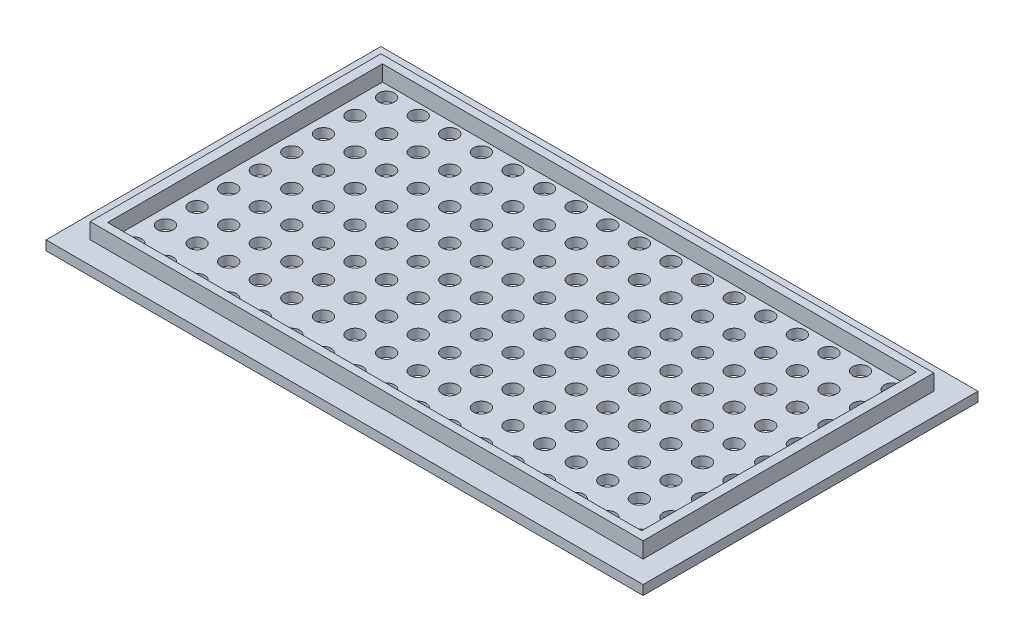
from build123d import *

# Parameters (mm, degrees)
SCHIZZO1_W                   = 189
SCHIZZO1_H                   = 106
SCHIZZO1_R                   = 2.5
ESTRUSIONE_ESTRUSIONE1_DEPTH = 3
SCHIZZO2_W                   = 175
SCHIZZO2_H                   = 92
SCHIZZO2_W_2                 = 169
SCHIZZO2_H_2                 = 87
ESTRUSIONE_ESTRUSIONE2_DEPTH = 5


with BuildPart() as part:
    # Schizzo1 → Estrusione-Estrusione1 (new body)
    with BuildSketch(Plane(origin=(0, 0, 0), x_dir=(1, 0, 0), z_dir=(0, 1, 0))):
        with Locations((-119.436215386, 8.367406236)):
            Rectangle(SCHIZZO1_W, SCHIZZO1_H)
        with Locations(Location((-199.037422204, 48.281681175, 0), (0, 0, 270))):
            Circle(SCHIZZO1_R, mode=Mode.SUBTRACT)
        with Locations(Location((-189.037422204, 48.281681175, 0), (0, 0, 270))):
            Circle(SCHIZZO1_R, mode=Mode.SUBTRACT)
        with Locations(Location((-179.037422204, 48.281681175, 0), (0, 0, 270))):
            Circle(SCHIZZO1_R, mode=Mode.SUBTRACT)
        with Locations(Location((-169.037422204, 48.281681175, 0), (0, 0, 270))):
            Circle(SCHIZZO1_R, mode=Mode.SUBTRACT)
        with Locations(Location((-159.037422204, 48.281681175, 0), (0, 0, 270))):
            Circle(SCHIZZO1_R, mode=Mode.SUBTRACT)
        with Locations(Location((-149.037422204, 48.281681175, 0), (0, 0, 270))):
            Circle(SCHIZZO1_R, mode=Mode.SUBTRACT)
        with Locations(Location((-139.037422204, 48.281681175, 0), (0, 0, 270))):
            Circle(SCHIZZO1_R, mode=Mode.SUBTRACT)
        with Locations(Location((-129.037422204, 48.281681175, 0), (0, 0, 270))):
            Circle(SCHIZZO1_R, mode=Mode.SUBTRACT)
        with Locations(Location((-119.037422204, 48.281681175, 0), (0, 0, 270))):
            Circle(SCHIZZO1_R, mode=Mode.SUBTRACT)
        with Locations(Location((-109.037422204, 48.281681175, 0), (0, 0, 270))):
            Circle(SCHIZZO1_R, mode=Mode.SUBTRACT)
        with Locations(Location((-99.037422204, 48.281681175, 0), (0, 0, 270))):
            Circle(SCHIZZO1_R, mode=Mode.SUBTRACT)
        with Locations(Location((-89.037422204, 48.281681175, 0), (0, 0, 270))):
            Circle(SCHIZZO1_R, mode=Mode.SUBTRACT)
        with Locations(Location((-79.037422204, 48.281681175, 0), (0, 0, 270))):
            Circle(SCHIZZO1_R, mode=Mode.SUBTRACT)
        with Locations(Location((-69.037422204, 48.281681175, 0), (0, 0, 270))):
            Circle(SCHIZZO1_R, mode=Mode.SUBTRACT)
        with Locations(Location((-59.037422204, 48.281681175, 0), (0, 0, 270))):
            Circle(SCHIZZO1_R, mode=Mode.SUBTRACT)
        with Locations(Location((-49.037422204, 48.281681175, 0), (0, 0, 270))):
            Circle(SCHIZZO1_R, mode=Mode.SUBTRACT)
        with Locations(Location((-39.037422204, 48.281681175, 0), (0, 0, 270))):
            Circle(SCHIZZO1_R, mode=Mode.SUBTRACT)
        with Locations(Location((-189.037422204, 38.281681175, 0), (0, 0, 270))):
            Circle(SCHIZZO1_R, mode=Mode.SUBTRACT)
        with Locations(Location((-179.037422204, 38.281681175, 0), (0, 0, 270))):
            Circle(SCHIZZO1_R, mode=Mode.SUBTRACT)
        with Locations(Location((-169.037422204, 38.281681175, 0), (0, 0, 270))):
            Circle(SCHIZZO1_R, mode=Mode.SUBTRACT)
        with Locations(Location((-159.037422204, 38.281681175, 0), (0, 0, 270))):
            Circle(SCHIZZO1_R, mode=Mode.SUBTRACT)
        with Locations(Location((-149.037422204, 38.281681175, 0), (0, 0, 270))):
            Circle(SCHIZZO1_R, mode=Mode.SUBTRACT)
        with Locations(Location((-139.037422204, 38.281681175, 0), (0, 0, 270))):
            Circle(SCHIZZO1_R, mode=Mode.SUBTRACT)
        with Locations(Location((-129.037422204, 38.281681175, 0), (0, 0, 270))):
            Circle(SCHIZZO1_R, mode=Mode.SUBTRACT)
        with Locations(Location((-119.037422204, 38.281681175, 0), (0, 0, 270))):
            Circle(SCHIZZO1_R, mode=Mode.SUBTRACT)
        with Locations(Location((-109.037422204, 38.281681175, 0), (0, 0, 270))):
            Circle(SCHIZZO1_R, mode=Mode.SUBTRACT)
        with Locations(Location((-99.037422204, 38.281681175, 0), (0, 0, 270))):
            Circle(SCHIZZO1_R, mode=Mode.SUBTRACT)
        with Locations(Location((-89.037422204, 38.281681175, 0), (0, 0, 270))):
            Circle(SCHIZZO1_R, mode=Mode.SUBTRACT)
        with Locations(Location((-79.037422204, 38.281681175, 0), (0, 0, 270))):
            Circle(SCHIZZO1_R, mode=Mode.SUBTRACT)
        with Locations(Location((-69.037422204, 38.281681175, 0), (0, 0, 270))):
            Circle(SCHIZZO1_R, mode=Mode.SUBTRACT)
        with Locations(Location((-59.037422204, 38.281681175, 0), (0, 0, 270))):
            Circle(SCHIZZO1_R, mode=Mode.SUBTRACT)
        with Locations(Location((-49.037422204, 38.281681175, 0), (0, 0, 270))):
            Circle(SCHIZZO1_R, mode=Mode.SUBTRACT)
        with Locations(Location((-39.037422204, 38.281681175, 0), (0, 0, 270))):
            Circle(SCHIZZO1_R, mode=Mode.SUBTRACT)
        with Locations(Location((-189.037422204, 28.281681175, 0), (0, 0, 270))):
            Circle(SCHIZZO1_R, mode=Mode.SUBTRACT)
        with Locations(Location((-179.037422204, 28.281681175, 0), (0, 0, 270))):
            Circle(SCHIZZO1_R, mode=Mode.SUBTRACT)
        with Locations(Location((-169.037422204, 28.281681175, 0), (0, 0, 270))):
            Circle(SCHIZZO1_R, mode=Mode.SUBTRACT)
        with Locations(Location((-159.037422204, 28.281681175, 0), (0, 0, 270))):
            Circle(SCHIZZO1_R, mode=Mode.SUBTRACT)
        with Locations(Location((-149.037422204, 28.281681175, 0), (0, 0, 270))):
            Circle(SCHIZZO1_R, mode=Mode.SUBTRACT)
        with Locations(Location((-139.037422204, 28.281681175, 0), (0, 0, 270))):
            Circle(SCHIZZO1_R, mode=Mode.SUBTRACT)
        with Locations(Location((-129.037422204, 28.281681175, 0), (0, 0, 270))):
            Circle(SCHIZZO1_R, mode=Mode.SUBTRACT)
        with Locations(Location((-119.037422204, 28.281681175, 0), (0, 0, 270))):
            Circle(SCHIZZO1_R, mode=Mode.SUBTRACT)
        with Locations(Location((-109.037422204, 28.281681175, 0), (0, 0, 270))):
            Circle(SCHIZZO1_R, mode=Mode.SUBTRACT)
        with Locations(Location((-99.037422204, 28.281681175, 0), (0, 0, 270))):
            Circle(SCHIZZO1_R, mode=Mode.SUBTRACT)
        with Locations(Location((-89.037422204, 28.281681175, 0), (0, 0, 270))):
            Circle(SCHIZZO1_R, mode=Mode.SUBTRACT)
        with Locations(Location((-79.037422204, 28.281681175, 0), (0, 0, 270))):
            Circle(SCHIZZO1_R, mode=Mode.SUBTRACT)
        with Locations(Location((-69.037422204, 28.281681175, 0), (0, 0, 270))):
            Circle(SCHIZZO1_R, mode=Mode.SUBTRACT)
        with Locations(Location((-59.037422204, 28.281681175, 0), (0, 0, 270))):
            Circle(SCHIZZO1_R, mode=Mode.SUBTRACT)
        with Locations(Location((-49.037422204, 28.281681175, 0), (0, 0, 270))):
            Circle(SCHIZZO1_R, mode=Mode.SUBTRACT)
        with Locations(Location((-39.037422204, 28.281681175, 0), (0, 0, 270))):
            Circle(SCHIZZO1_R, mode=Mode.SUBTRACT)
        with Locations(Location((-189.037422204, 18.281681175, 0), (0, 0, 270))):
            Circle(SCHIZZO1_R, mode=Mode.SUBTRACT)
        with Locations(Location((-179.037422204, 18.281681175, 0), (0, 0, 270))):
            Circle(SCHIZZO1_R, mode=Mode.SUBTRACT)
        with Locations(Location((-169.037422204, 18.281681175, 0), (0, 0, 270))):
            Circle(SCHIZZO1_R, mode=Mode.SUBTRACT)
        with Locations(Location((-159.037422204, 18.281681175, 0), (0, 0, 270))):
            Circle(SCHIZZO1_R, mode=Mode.SUBTRACT)
        with Locations(Location((-149.037422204, 18.281681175, 0), (0, 0, 270))):
            Circle(SCHIZZO1_R, mode=Mode.SUBTRACT)
        with Locations(Location((-139.037422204, 18.281681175, 0), (0, 0, 270))):
            Circle(SCHIZZO1_R, mode=Mode.SUBTRACT)
        with Locations(Location((-129.037422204, 18.281681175, 0), (0, 0, 270))):
            Circle(SCHIZZO1_R, mode=Mode.SUBTRACT)
        with Locations(Location((-119.037422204, 18.281681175, 0), (0, 0, 270))):
            Circle(SCHIZZO1_R, mode=Mode.SUBTRACT)
        with Locations(Location((-109.037422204, 18.281681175, 0), (0, 0, 270))):
            Circle(SCHIZZO1_R, mode=Mode.SUBTRACT)
        with Locations(Location((-99.037422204, 18.281681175, 0), (0, 0, 270))):
            Circle(SCHIZZO1_R, mode=Mode.SUBTRACT)
        with Locations(Location((-89.037422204, 18.281681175, 0), (0, 0, 270))):
            Circle(SCHIZZO1_R, mode=Mode.SUBTRACT)
        with Locations(Location((-79.037422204, 18.281681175, 0), (0, 0, 270))):
            Circle(SCHIZZO1_R, mode=Mode.SUBTRACT)
        with Locations(Location((-69.037422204, 18.281681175, 0), (0, 0, 270))):
            Circle(SCHIZZO1_R, mode=Mode.SUBTRACT)
        with Locations(Location((-59.037422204, 18.281681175, 0), (0, 0, 270))):
            Circle(SCHIZZO1_R, mode=Mode.SUBTRACT)
        with Locations(Location((-49.037422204, 18.281681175, 0), (0, 0, 270))):
            Circle(SCHIZZO1_R, mode=Mode.SUBTRACT)
        with Locations(Location((-39.037422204, 18.281681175, 0), (0, 0, 270))):
            Circle(SCHIZZO1_R, mode=Mode.SUBTRACT)
        with Locations(Location((-189.037422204, 8.281681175, 0), (0, 0, 270))):
            Circle(SCHIZZO1_R, mode=Mode.SUBTRACT)
        with Locations(Location((-179.037422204, 8.281681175, 0), (0, 0, 270))):
            Circle(SCHIZZO1_R, mode=Mode.SUBTRACT)
        with Locations(Location((-169.037422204, 8.281681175, 0), (0, 0, 270))):
            Circle(SCHIZZO1_R, mode=Mode.SUBTRACT)
        with Locations(Location((-159.037422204, 8.281681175, 0), (0, 0, 270))):
            Circle(SCHIZZO1_R, mode=Mode.SUBTRACT)
        with Locations(Location((-149.037422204, 8.281681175, 0), (0, 0, 270))):
            Circle(SCHIZZO1_R, mode=Mode.SUBTRACT)
        with Locations(Location((-139.037422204, 8.281681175, 0), (0, 0, 270))):
            Circle(SCHIZZO1_R, mode=Mode.SUBTRACT)
        with Locations(Location((-129.037422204, 8.281681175, 0), (0, 0, 270))):
            Circle(SCHIZZO1_R, mode=Mode.SUBTRACT)
        with Locations(Location((-119.037422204, 8.281681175, 0), (0, 0, 270))):
            Circle(SCHIZZO1_R, mode=Mode.SUBTRACT)
        with Locations(Location((-109.037422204, 8.281681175, 0), (0, 0, 270))):
            Circle(SCHIZZO1_R, mode=Mode.SUBTRACT)
        with Locations(Location((-99.037422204, 8.281681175, 0), (0, 0, 270))):
            Circle(SCHIZZO1_R, mode=Mode.SUBTRACT)
        with Locations(Location((-89.037422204, 8.281681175, 0), (0, 0, 270))):
            Circle(SCHIZZO1_R, mode=Mode.SUBTRACT)
        with Locations(Location((-79.037422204, 8.281681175, 0), (0, 0, 270))):
            Circle(SCHIZZO1_R, mode=Mode.SUBTRACT)
        with Locations(Location((-69.037422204, 8.281681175, 0), (0, 0, 270))):
            Circle(SCHIZZO1_R, mode=Mode.SUBTRACT)
        with Locations(Location((-59.037422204, 8.281681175, 0), (0, 0, 270))):
            Circle(SCHIZZO1_R, mode=Mode.SUBTRACT)
        with Locations(Location((-49.037422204, 8.281681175, 0), (0, 0, 270))):
            Circle(SCHIZZO1_R, mode=Mode.SUBTRACT)
        with Locations(Location((-39.037422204, 8.281681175, 0), (0, 0, 270))):
            Circle(SCHIZZO1_R, mode=Mode.SUBTRACT)
        with Locations(Location((-189.037422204, -1.718318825, 0), (0, 0, 270))):
            Circle(SCHIZZO1_R, mode=Mode.SUBTRACT)
        with Locations(Location((-179.037422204, -1.718318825, 0), (0, 0, 270))):
            Circle(SCHIZZO1_R, mode=Mode.SUBTRACT)
        with Locations(Location((-169.037422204, -1.718318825, 0), (0, 0, 270))):
            Circle(SCHIZZO1_R, mode=Mode.SUBTRACT)
        with Locations(Location((-159.037422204, -1.718318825, 0), (0, 0, 270))):
            Circle(SCHIZZO1_R, mode=Mode.SUBTRACT)
        with Locations(Location((-149.037422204, -1.718318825, 0), (0, 0, 270))):
            Circle(SCHIZZO1_R, mode=Mode.SUBTRACT)
        with Locations(Location((-139.037422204, -1.718318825, 0), (0, 0, 270))):
            Circle(SCHIZZO1_R, mode=Mode.SUBTRACT)
        with Locations(Location((-129.037422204, -1.718318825, 0), (0, 0, 270))):
            Circle(SCHIZZO1_R, mode=Mode.SUBTRACT)
        with Locations(Location((-119.037422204, -1.718318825, 0), (0, 0, 270))):
            Circle(SCHIZZO1_R, mode=Mode.SUBTRACT)
        with Locations(Location((-109.037422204, -1.718318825, 0), (0, 0, 270))):
            Circle(SCHIZZO1_R, mode=Mode.SUBTRACT)
        with Locations(Location((-99.037422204, -1.718318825, 0), (0, 0, 270))):
            Circle(SCHIZZO1_R, mode=Mode.SUBTRACT)
        with Locations(Location((-89.037422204, -1.718318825, 0), (0, 0, 270))):
            Circle(SCHIZZO1_R, mode=Mode.SUBTRACT)
        with Locations(Location((-79.037422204, -1.718318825, 0), (0, 0, 270))):
            Circle(SCHIZZO1_R, mode=Mode.SUBTRACT)
        with Locations(Location((-69.037422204, -1.718318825, 0), (0, 0, 270))):
            Circle(SCHIZZO1_R, mode=Mode.SUBTRACT)
        with Locations(Location((-59.037422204, -1.718318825, 0), (0, 0, 270))):
            Circle(SCHIZZO1_R, mode=Mode.SUBTRACT)
        with Locations(Location((-49.037422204, -1.718318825, 0), (0, 0, 270))):
            Circle(SCHIZZO1_R, mode=Mode.SUBTRACT)
        with Locations(Location((-39.037422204, -1.718318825, 0), (0, 0, 270))):
            Circle(SCHIZZO1_R, mode=Mode.SUBTRACT)
        with Locations(Location((-189.037422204, -11.718318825, 0), (0, 0, 270))):
            Circle(SCHIZZO1_R, mode=Mode.SUBTRACT)
        with Locations(Location((-179.037422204, -11.718318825, 0), (0, 0, 270))):
            Circle(SCHIZZO1_R, mode=Mode.SUBTRACT)
        with Locations(Location((-169.037422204, -11.718318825, 0), (0, 0, 270))):
            Circle(SCHIZZO1_R, mode=Mode.SUBTRACT)
        with Locations(Location((-159.037422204, -11.718318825, 0), (0, 0, 270))):
            Circle(SCHIZZO1_R, mode=Mode.SUBTRACT)
        with Locations(Location((-149.037422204, -11.718318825, 0), (0, 0, 270))):
            Circle(SCHIZZO1_R, mode=Mode.SUBTRACT)
        with Locations(Location((-139.037422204, -11.718318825, 0), (0, 0, 270))):
            Circle(SCHIZZO1_R, mode=Mode.SUBTRACT)
        with Locations(Location((-129.037422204, -11.718318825, 0), (0, 0, 270))):
            Circle(SCHIZZO1_R, mode=Mode.SUBTRACT)
        with Locations(Location((-119.037422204, -11.718318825, 0), (0, 0, 270))):
            Circle(SCHIZZO1_R, mode=Mode.SUBTRACT)
        with Locations(Location((-109.037422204, -11.718318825, 0), (0, 0, 270))):
            Circle(SCHIZZO1_R, mode=Mode.SUBTRACT)
        with Locations(Location((-99.037422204, -11.718318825, 0), (0, 0, 270))):
            Circle(SCHIZZO1_R, mode=Mode.SUBTRACT)
        with Locations(Location((-89.037422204, -11.718318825, 0), (0, 0, 270))):
            Circle(SCHIZZO1_R, mode=Mode.SUBTRACT)
        with Locations(Location((-79.037422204, -11.718318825, 0), (0, 0, 270))):
            Circle(SCHIZZO1_R, mode=Mode.SUBTRACT)
        with Locations(Location((-69.037422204, -11.718318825, 0), (0, 0, 270))):
            Circle(SCHIZZO1_R, mode=Mode.SUBTRACT)
        with Locations(Location((-59.037422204, -11.718318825, 0), (0, 0, 270))):
            Circle(SCHIZZO1_R, mode=Mode.SUBTRACT)
        with Locations(Location((-49.037422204, -11.718318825, 0), (0, 0, 270))):
            Circle(SCHIZZO1_R, mode=Mode.SUBTRACT)
        with Locations(Location((-39.037422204, -11.718318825, 0), (0, 0, 270))):
            Circle(SCHIZZO1_R, mode=Mode.SUBTRACT)
        with Locations(Location((-189.037422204, -21.718318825, 0), (0, 0, 270))):
            Circle(SCHIZZO1_R, mode=Mode.SUBTRACT)
        with Locations(Location((-179.037422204, -21.718318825, 0), (0, 0, 270))):
            Circle(SCHIZZO1_R, mode=Mode.SUBTRACT)
        with Locations(Location((-169.037422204, -21.718318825, 0), (0, 0, 270))):
            Circle(SCHIZZO1_R, mode=Mode.SUBTRACT)
        with Locations(Location((-159.037422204, -21.718318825, 0), (0, 0, 270))):
            Circle(SCHIZZO1_R, mode=Mode.SUBTRACT)
        with Locations(Location((-149.037422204, -21.718318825, 0), (0, 0, 270))):
            Circle(SCHIZZO1_R, mode=Mode.SUBTRACT)
        with Locations(Location((-139.037422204, -21.718318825, 0), (0, 0, 270))):
            Circle(SCHIZZO1_R, mode=Mode.SUBTRACT)
        with Locations(Location((-129.037422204, -21.718318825, 0), (0, 0, 270))):
            Circle(SCHIZZO1_R, mode=Mode.SUBTRACT)
        with Locations(Location((-119.037422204, -21.718318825, 0), (0, 0, 270))):
            Circle(SCHIZZO1_R, mode=Mode.SUBTRACT)
        with Locations(Location((-109.037422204, -21.718318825, 0), (0, 0, 270))):
            Circle(SCHIZZO1_R, mode=Mode.SUBTRACT)
        with Locations(Location((-99.037422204, -21.718318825, 0), (0, 0, 270))):
            Circle(SCHIZZO1_R, mode=Mode.SUBTRACT)
        with Locations(Location((-89.037422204, -21.718318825, 0), (0, 0, 270))):
            Circle(SCHIZZO1_R, mode=Mode.SUBTRACT)
        with Locations(Location((-79.037422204, -21.718318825, 0), (0, 0, 270))):
            Circle(SCHIZZO1_R, mode=Mode.SUBTRACT)
        with Locations(Location((-69.037422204, -21.718318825, 0), (0, 0, 270))):
            Circle(SCHIZZO1_R, mode=Mode.SUBTRACT)
        with Locations(Location((-59.037422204, -21.718318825, 0), (0, 0, 270))):
            Circle(SCHIZZO1_R, mode=Mode.SUBTRACT)
        with Locations(Location((-49.037422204, -21.718318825, 0), (0, 0, 270))):
            Circle(SCHIZZO1_R, mode=Mode.SUBTRACT)
        with Locations(Location((-39.037422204, -21.718318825, 0), (0, 0, 270))):
            Circle(SCHIZZO1_R, mode=Mode.SUBTRACT)
        with Locations(Location((-189.037422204, -31.718318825, 0), (0, 0, 270))):
            Circle(SCHIZZO1_R, mode=Mode.SUBTRACT)
        with Locations(Location((-179.037422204, -31.718318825, 0), (0, 0, 270))):
            Circle(SCHIZZO1_R, mode=Mode.SUBTRACT)
        with Locations(Location((-169.037422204, -31.718318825, 0), (0, 0, 270))):
            Circle(SCHIZZO1_R, mode=Mode.SUBTRACT)
        with Locations(Location((-159.037422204, -31.718318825, 0), (0, 0, 270))):
            Circle(SCHIZZO1_R, mode=Mode.SUBTRACT)
        with Locations(Location((-149.037422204, -31.718318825, 0), (0, 0, 270))):
            Circle(SCHIZZO1_R, mode=Mode.SUBTRACT)
        with Locations(Location((-139.037422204, -31.718318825, 0), (0, 0, 270))):
            Circle(SCHIZZO1_R, mode=Mode.SUBTRACT)
        with Locations(Location((-129.037422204, -31.718318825, 0), (0, 0, 270))):
            Circle(SCHIZZO1_R, mode=Mode.SUBTRACT)
        with Locations(Location((-119.037422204, -31.718318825, 0), (0, 0, 270))):
            Circle(SCHIZZO1_R, mode=Mode.SUBTRACT)
        with Locations(Location((-109.037422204, -31.718318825, 0), (0, 0, 270))):
            Circle(SCHIZZO1_R, mode=Mode.SUBTRACT)
        with Locations(Location((-99.037422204, -31.718318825, 0), (0, 0, 270))):
            Circle(SCHIZZO1_R, mode=Mode.SUBTRACT)
        with Locations(Location((-89.037422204, -31.718318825, 0), (0, 0, 270))):
            Circle(SCHIZZO1_R, mode=Mode.SUBTRACT)
        with Locations(Location((-79.037422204, -31.718318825, 0), (0, 0, 270))):
            Circle(SCHIZZO1_R, mode=Mode.SUBTRACT)
        with Locations(Location((-69.037422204, -31.718318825, 0), (0, 0, 270))):
            Circle(SCHIZZO1_R, mode=Mode.SUBTRACT)
        with Locations(Location((-59.037422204, -31.718318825, 0), (0, 0, 270))):
            Circle(SCHIZZO1_R, mode=Mode.SUBTRACT)
        with Locations(Location((-49.037422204, -31.718318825, 0), (0, 0, 270))):
            Circle(SCHIZZO1_R, mode=Mode.SUBTRACT)
        with Locations(Location((-39.037422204, -31.718318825, 0), (0, 0, 270))):
            Circle(SCHIZZO1_R, mode=Mode.SUBTRACT)
        with Locations(Location((-199.037422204, 38.281681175, 0), (0, 0, 270))):
            Circle(SCHIZZO1_R, mode=Mode.SUBTRACT)
        with Locations(Location((-199.037422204, 28.281681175, 0), (0, 0, 270))):
            Circle(SCHIZZO1_R, mode=Mode.SUBTRACT)
        with Locations(Location((-199.037422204, 18.281681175, 0), (0, 0, 270))):
            Circle(SCHIZZO1_R, mode=Mode.SUBTRACT)
        with Locations(Location((-199.037422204, 8.281681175, 0), (0, 0, 270))):
            Circle(SCHIZZO1_R, mode=Mode.SUBTRACT)
        with Locations(Location((-199.037422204, -1.718318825, 0), (0, 0, 270))):
            Circle(SCHIZZO1_R, mode=Mode.SUBTRACT)
        with Locations(Location((-199.037422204, -11.718318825, 0), (0, 0, 270))):
            Circle(SCHIZZO1_R, mode=Mode.SUBTRACT)
        with Locations(Location((-199.037422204, -21.718318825, 0), (0, 0, 270))):
            Circle(SCHIZZO1_R, mode=Mode.SUBTRACT)
        with Locations(Location((-199.037422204, -31.718318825, 0), (0, 0, 270))):
            Circle(SCHIZZO1_R, mode=Mode.SUBTRACT)
    extrude(amount=ESTRUSIONE_ESTRUSIONE1_DEPTH)

    # Schizzo2 → Estrusione-Estrusione2 (add)
    with BuildSketch(Plane(origin=(0, 3, 0), x_dir=(1, 0, 0), z_dir=(0, 1, 0))):
        with Locations((-119.436215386, 8.367406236)):
            Rectangle(SCHIZZO2_W, SCHIZZO2_H)
        with Locations((-119.436215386, 8.367406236)):
            Rectangle(SCHIZZO2_W_2, SCHIZZO2_H_2, mode=Mode.SUBTRACT)
    extrude(amount=ESTRUSIONE_ESTRUSIONE2_DEPTH)


solid = part.part
